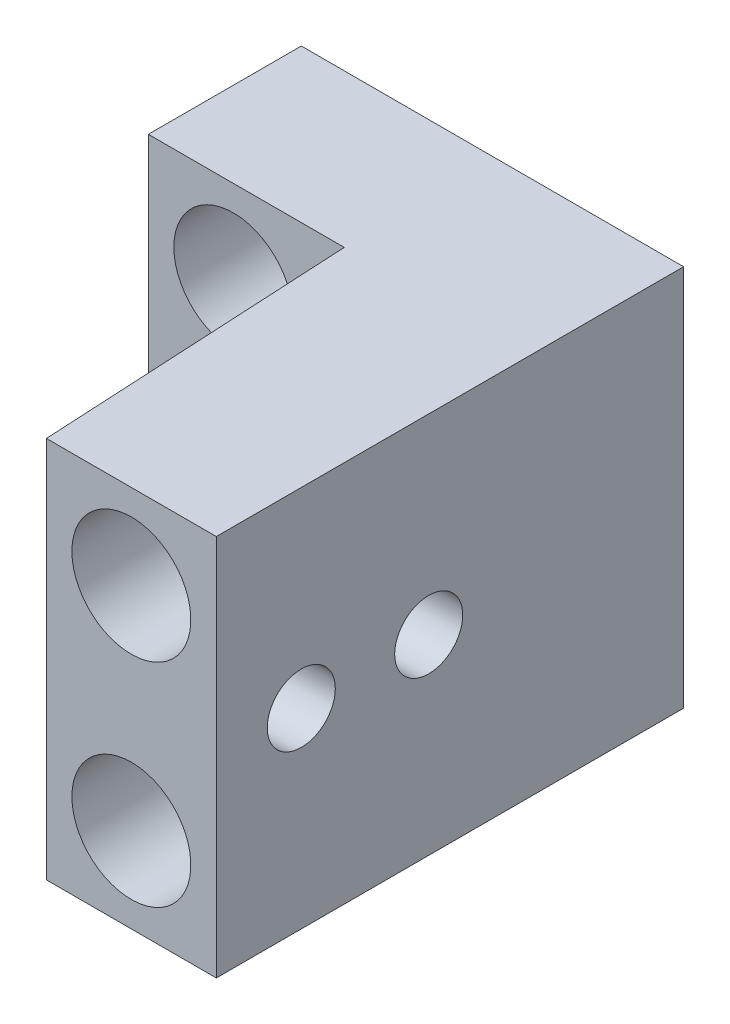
ISO-10303-21;
HEADER;
FILE_DESCRIPTION(('STEP AP214'),'2;1');
FILE_NAME('part.step','',(''),(''),'','','');
FILE_SCHEMA(('AUTOMOTIVE_DESIGN { 1 0 10303 214 1 1 1 1 }'));
ENDSEC;
DATA;
#1=APPLICATION_CONTEXT('core data for automotive mechanical design processes');
#2=APPLICATION_PROTOCOL_DEFINITION('international standard','automotive_design',2000,#1);
#3=PRODUCT_CONTEXT('',#1,'mechanical');
#4=PRODUCT('Part','Part','',(#3));
#5=PRODUCT_RELATED_PRODUCT_CATEGORY('part','',(#4));
#6=PRODUCT_DEFINITION_FORMATION('','',#4);
#7=PRODUCT_DEFINITION_CONTEXT('part definition',#1,'design');
#8=PRODUCT_DEFINITION('design','',#6,#7);
#9=PRODUCT_DEFINITION_SHAPE('','',#8);
#10=(LENGTH_UNIT() NAMED_UNIT(*) SI_UNIT(.MILLI.,.METRE.));
#11=(NAMED_UNIT(*) PLANE_ANGLE_UNIT() SI_UNIT($,.RADIAN.));
#12=(NAMED_UNIT(*) SI_UNIT($,.STERADIAN.) SOLID_ANGLE_UNIT());
#13=UNCERTAINTY_MEASURE_WITH_UNIT(LENGTH_MEASURE(1.E-05),#10,'distance_accuracy_value','');
#14=(GEOMETRIC_REPRESENTATION_CONTEXT(3) GLOBAL_UNCERTAINTY_ASSIGNED_CONTEXT((#13)) GLOBAL_UNIT_ASSIGNED_CONTEXT((#10,
#11,#12)) REPRESENTATION_CONTEXT('',''));
#15=CARTESIAN_POINT('',(0.,0.,0.));
#16=DIRECTION('',(0.,0.,1.));
#17=DIRECTION('',(1.,0.,0.));
#18=AXIS2_PLACEMENT_3D('',#15,#16,#17);
#19=CARTESIAN_POINT('',(-10.,-10.,18.));
#20=DIRECTION('',(0.,0.,1.));
#21=DIRECTION('',(-1.,0.,0.));
#22=AXIS2_PLACEMENT_3D('',#19,#20,#21);
#23=PLANE('',#22);
#24=CARTESIAN_POINT('',(0.,25.,18.));
#25=DIRECTION('',(0.,0.,1.));
#26=DIRECTION('',(-1.,0.,0.));
#27=AXIS2_PLACEMENT_3D('',#24,#25,#26);
#28=CIRCLE('',#27,7.);
#29=CARTESIAN_POINT('',(-7.,25.,18.));
#30=VERTEX_POINT('',#29);
#31=EDGE_CURVE('E147',#30,#30,#28,.T.);
#32=ORIENTED_EDGE('',*,*,#31,.F.);
#33=EDGE_LOOP('',(#32));
#34=FACE_BOUND('',#33,.T.);
#35=DIRECTION('',(1.,0.,0.));
#36=VECTOR('',#35,1.);
#37=CARTESIAN_POINT('',(-10.,-10.,18.));
#38=LINE('',#37,#36);
#39=CARTESIAN_POINT('',(-10.,-10.,18.));
#40=VERTEX_POINT('',#39);
#41=CARTESIAN_POINT('',(13.0609121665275,-10.,18.));
#42=VERTEX_POINT('',#41);
#43=EDGE_CURVE('E104',#40,#42,#38,.T.);
#44=ORIENTED_EDGE('',*,*,#43,.T.);
#45=DIRECTION('',(0.,1.,0.));
#46=VECTOR('',#45,1.);
#47=CARTESIAN_POINT('',(13.0609121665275,-10.,18.));
#48=LINE('',#47,#46);
#49=CARTESIAN_POINT('',(13.0609121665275,35.,18.));
#50=VERTEX_POINT('',#49);
#51=EDGE_CURVE('E75',#42,#50,#48,.T.);
#52=ORIENTED_EDGE('',*,*,#51,.T.);
#53=DIRECTION('',(1.,0.,0.));
#54=VECTOR('',#53,1.);
#55=CARTESIAN_POINT('',(-10.,35.,18.));
#56=LINE('',#55,#54);
#57=CARTESIAN_POINT('',(-10.,35.,18.));
#58=VERTEX_POINT('',#57);
#59=EDGE_CURVE('E82',#58,#50,#56,.T.);
#60=ORIENTED_EDGE('',*,*,#59,.F.);
#61=DIRECTION('',(0.,1.,0.));
#62=VECTOR('',#61,1.);
#63=CARTESIAN_POINT('',(-10.,-10.,18.));
#64=LINE('',#63,#62);
#65=EDGE_CURVE('E65',#40,#58,#64,.T.);
#66=ORIENTED_EDGE('',*,*,#65,.F.);
#67=EDGE_LOOP('',(#44,#52,#60,#66));
#68=FACE_BOUND('',#67,.T.);
#69=CARTESIAN_POINT('',(0.,0.,18.));
#70=DIRECTION('',(0.,0.,1.));
#71=DIRECTION('',(-1.,0.,0.));
#72=AXIS2_PLACEMENT_3D('',#69,#70,#71);
#73=CIRCLE('',#72,7.);
#74=CARTESIAN_POINT('',(-7.,0.,18.));
#75=VERTEX_POINT('',#74);
#76=EDGE_CURVE('E135',#75,#75,#73,.T.);
#77=ORIENTED_EDGE('',*,*,#76,.F.);
#78=EDGE_LOOP('',(#77));
#79=FACE_BOUND('',#78,.T.);
#80=ADVANCED_FACE('F14',(#34,#68,#79),#23,.T.);
#81=CARTESIAN_POINT('',(35.,-10.,0.));
#82=DIRECTION('',(0.,0.,-1.));
#83=DIRECTION('',(1.,0.,0.));
#84=AXIS2_PLACEMENT_3D('',#81,#82,#83);
#85=PLANE('',#84);
#86=CARTESIAN_POINT('',(0.,25.,0.));
#87=DIRECTION('',(0.,0.,1.));
#88=DIRECTION('',(-1.,0.,0.));
#89=AXIS2_PLACEMENT_3D('',#86,#87,#88);
#90=CIRCLE('',#89,4.5);
#91=CARTESIAN_POINT('',(-4.5,25.,0.));
#92=VERTEX_POINT('',#91);
#93=EDGE_CURVE('E138',#92,#92,#90,.T.);
#94=ORIENTED_EDGE('',*,*,#93,.T.);
#95=EDGE_LOOP('',(#94));
#96=FACE_BOUND('',#95,.T.);
#97=CARTESIAN_POINT('',(25.,25.,0.));
#98=DIRECTION('',(0.,0.,1.));
#99=DIRECTION('',(-1.,0.,0.));
#100=AXIS2_PLACEMENT_3D('',#97,#98,#99);
#101=CIRCLE('',#100,4.5);
#102=CARTESIAN_POINT('',(20.5,25.,0.));
#103=VERTEX_POINT('',#102);
#104=EDGE_CURVE('E86',#103,#103,#101,.T.);
#105=ORIENTED_EDGE('',*,*,#104,.T.);
#106=EDGE_LOOP('',(#105));
#107=FACE_BOUND('',#106,.T.);
#108=DIRECTION('',(0.,1.,0.));
#109=VECTOR('',#108,1.);
#110=CARTESIAN_POINT('',(35.,-10.,0.));
#111=LINE('',#110,#109);
#112=CARTESIAN_POINT('',(35.,-10.,0.));
#113=VERTEX_POINT('',#112);
#114=CARTESIAN_POINT('',(35.,35.,0.));
#115=VERTEX_POINT('',#114);
#116=EDGE_CURVE('E23',#113,#115,#111,.T.);
#117=ORIENTED_EDGE('',*,*,#116,.F.);
#118=DIRECTION('',(-1.,0.,0.));
#119=VECTOR('',#118,1.);
#120=CARTESIAN_POINT('',(35.,-10.,0.));
#121=LINE('',#120,#119);
#122=CARTESIAN_POINT('',(-10.,-10.,0.));
#123=VERTEX_POINT('',#122);
#124=EDGE_CURVE('E76',#113,#123,#121,.T.);
#125=ORIENTED_EDGE('',*,*,#124,.T.);
#126=DIRECTION('',(0.,1.,0.));
#127=VECTOR('',#126,1.);
#128=CARTESIAN_POINT('',(-10.,-10.,0.));
#129=LINE('',#128,#127);
#130=CARTESIAN_POINT('',(-10.,35.,0.));
#131=VERTEX_POINT('',#130);
#132=EDGE_CURVE('E9',#123,#131,#129,.T.);
#133=ORIENTED_EDGE('',*,*,#132,.T.);
#134=DIRECTION('',(-1.,0.,0.));
#135=VECTOR('',#134,1.);
#136=CARTESIAN_POINT('',(35.,35.,0.));
#137=LINE('',#136,#135);
#138=EDGE_CURVE('E85',#115,#131,#137,.T.);
#139=ORIENTED_EDGE('',*,*,#138,.F.);
#140=EDGE_LOOP('',(#117,#125,#133,#139));
#141=FACE_BOUND('',#140,.T.);
#142=CARTESIAN_POINT('',(25.,0.,0.));
#143=DIRECTION('',(0.,0.,1.));
#144=DIRECTION('',(-1.,0.,0.));
#145=AXIS2_PLACEMENT_3D('',#142,#143,#144);
#146=CIRCLE('',#145,4.5);
#147=CARTESIAN_POINT('',(20.5,0.,0.));
#148=VERTEX_POINT('',#147);
#149=EDGE_CURVE('E159',#148,#148,#146,.T.);
#150=ORIENTED_EDGE('',*,*,#149,.T.);
#151=EDGE_LOOP('',(#150));
#152=FACE_BOUND('',#151,.T.);
#153=CARTESIAN_POINT('',(0.,0.,0.));
#154=DIRECTION('',(0.,0.,1.));
#155=DIRECTION('',(-1.,0.,0.));
#156=AXIS2_PLACEMENT_3D('',#153,#154,#155);
#157=CIRCLE('',#156,4.5);
#158=CARTESIAN_POINT('',(-4.5,0.,0.));
#159=VERTEX_POINT('',#158);
#160=EDGE_CURVE('E119',#159,#159,#157,.T.);
#161=ORIENTED_EDGE('',*,*,#160,.T.);
#162=EDGE_LOOP('',(#161));
#163=FACE_BOUND('',#162,.T.);
#164=ADVANCED_FACE('F16',(#96,#107,#141,#152,#163),#85,.T.);
#165=CARTESIAN_POINT('',(15.,-10.,55.));
#166=DIRECTION('',(0.,0.,1.));
#167=DIRECTION('',(-1.,0.,0.));
#168=AXIS2_PLACEMENT_3D('',#165,#166,#167);
#169=PLANE('',#168);
#170=CARTESIAN_POINT('',(25.,25.,55.));
#171=DIRECTION('',(0.,0.,1.));
#172=DIRECTION('',(-1.,0.,0.));
#173=AXIS2_PLACEMENT_3D('',#170,#171,#172);
#174=CIRCLE('',#173,7.);
#175=CARTESIAN_POINT('',(18.,25.,55.));
#176=VERTEX_POINT('',#175);
#177=EDGE_CURVE('E162',#176,#176,#174,.T.);
#178=ORIENTED_EDGE('',*,*,#177,.F.);
#179=EDGE_LOOP('',(#178));
#180=FACE_BOUND('',#179,.T.);
#181=DIRECTION('',(0.,1.,0.));
#182=VECTOR('',#181,1.);
#183=CARTESIAN_POINT('',(15.,-10.,55.));
#184=LINE('',#183,#182);
#185=CARTESIAN_POINT('',(15.,-10.,55.));
#186=VERTEX_POINT('',#185);
#187=CARTESIAN_POINT('',(15.,35.,55.));
#188=VERTEX_POINT('',#187);
#189=EDGE_CURVE('E108',#186,#188,#184,.T.);
#190=ORIENTED_EDGE('',*,*,#189,.F.);
#191=DIRECTION('',(1.,0.,0.));
#192=VECTOR('',#191,1.);
#193=CARTESIAN_POINT('',(15.,-10.,55.));
#194=LINE('',#193,#192);
#195=CARTESIAN_POINT('',(35.,-10.,55.));
#196=VERTEX_POINT('',#195);
#197=EDGE_CURVE('E98',#186,#196,#194,.T.);
#198=ORIENTED_EDGE('',*,*,#197,.T.);
#199=DIRECTION('',(0.,1.,0.));
#200=VECTOR('',#199,1.);
#201=CARTESIAN_POINT('',(35.,-10.,55.));
#202=LINE('',#201,#200);
#203=CARTESIAN_POINT('',(35.,35.,55.));
#204=VERTEX_POINT('',#203);
#205=EDGE_CURVE('E110',#196,#204,#202,.T.);
#206=ORIENTED_EDGE('',*,*,#205,.T.);
#207=DIRECTION('',(1.,0.,0.));
#208=VECTOR('',#207,1.);
#209=CARTESIAN_POINT('',(15.,35.,55.));
#210=LINE('',#209,#208);
#211=EDGE_CURVE('E91',#188,#204,#210,.T.);
#212=ORIENTED_EDGE('',*,*,#211,.F.);
#213=EDGE_LOOP('',(#190,#198,#206,#212));
#214=FACE_BOUND('',#213,.T.);
#215=CARTESIAN_POINT('',(25.,0.,55.));
#216=DIRECTION('',(0.,0.,1.));
#217=DIRECTION('',(-1.,0.,0.));
#218=AXIS2_PLACEMENT_3D('',#215,#216,#217);
#219=CIRCLE('',#218,7.);
#220=CARTESIAN_POINT('',(18.,0.,55.));
#221=VERTEX_POINT('',#220);
#222=EDGE_CURVE('E150',#221,#221,#219,.T.);
#223=ORIENTED_EDGE('',*,*,#222,.F.);
#224=EDGE_LOOP('',(#223));
#225=FACE_BOUND('',#224,.T.);
#226=ADVANCED_FACE('F188',(#180,#214,#225),#169,.T.);
#227=CARTESIAN_POINT('',(-10.,35.,55.));
#228=DIRECTION('',(0.,1.,0.));
#229=DIRECTION('',(0.,0.,-1.));
#230=AXIS2_PLACEMENT_3D('',#227,#228,#229);
#231=PLANE('',#230);
#232=DIRECTION('',(0.,0.,1.));
#233=VECTOR('',#232,1.);
#234=CARTESIAN_POINT('',(-10.,35.,0.));
#235=LINE('',#234,#233);
#236=EDGE_CURVE('E68',#131,#58,#235,.T.);
#237=ORIENTED_EDGE('',*,*,#236,.T.);
#238=ORIENTED_EDGE('',*,*,#59,.T.);
#239=DIRECTION('',(-0.0523359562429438,0.,-0.998629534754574));
#240=VECTOR('',#239,1.);
#241=CARTESIAN_POINT('',(15.,35.,55.));
#242=LINE('',#241,#240);
#243=EDGE_CURVE('E89',#188,#50,#242,.T.);
#244=ORIENTED_EDGE('',*,*,#243,.F.);
#245=ORIENTED_EDGE('',*,*,#211,.T.);
#246=DIRECTION('',(0.,0.,-1.));
#247=VECTOR('',#246,1.);
#248=CARTESIAN_POINT('',(35.,35.,55.));
#249=LINE('',#248,#247);
#250=EDGE_CURVE('E174',#204,#115,#249,.T.);
#251=ORIENTED_EDGE('',*,*,#250,.T.);
#252=ORIENTED_EDGE('',*,*,#138,.T.);
#253=EDGE_LOOP('',(#237,#238,#244,#245,#251,#252));
#254=FACE_BOUND('',#253,.T.);
#255=ADVANCED_FACE('F80',(#254),#231,.T.);
#256=CARTESIAN_POINT('',(-10.,-10.,0.));
#257=DIRECTION('',(-1.,0.,0.));
#258=DIRECTION('',(0.,0.,-1.));
#259=AXIS2_PLACEMENT_3D('',#256,#257,#258);
#260=PLANE('',#259);
#261=ORIENTED_EDGE('',*,*,#132,.F.);
#262=DIRECTION('',(0.,0.,1.));
#263=VECTOR('',#262,1.);
#264=CARTESIAN_POINT('',(-10.,-10.,0.));
#265=LINE('',#264,#263);
#266=EDGE_CURVE('E70',#123,#40,#265,.T.);
#267=ORIENTED_EDGE('',*,*,#266,.T.);
#268=ORIENTED_EDGE('',*,*,#65,.T.);
#269=ORIENTED_EDGE('',*,*,#236,.F.);
#270=EDGE_LOOP('',(#261,#267,#268,#269));
#271=FACE_BOUND('',#270,.T.);
#272=ADVANCED_FACE('F67',(#271),#260,.T.);
#273=CARTESIAN_POINT('',(35.,-10.,55.));
#274=DIRECTION('',(1.,0.,0.));
#275=DIRECTION('',(0.,0.,1.));
#276=AXIS2_PLACEMENT_3D('',#273,#274,#275);
#277=PLANE('',#276);
#278=CARTESIAN_POINT('',(35.,12.5,30.));
#279=DIRECTION('',(1.,0.,0.));
#280=DIRECTION('',(0.,0.,1.));
#281=AXIS2_PLACEMENT_3D('',#278,#279,#280);
#282=ELLIPSE('',#281,4.00548938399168,4.);
#283=CARTESIAN_POINT('',(35.,12.5,34.0054893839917));
#284=VERTEX_POINT('',#283);
#285=EDGE_CURVE('E115',#284,#284,#282,.T.);
#286=ORIENTED_EDGE('',*,*,#285,.F.);
#287=EDGE_LOOP('',(#286));
#288=FACE_BOUND('',#287,.T.);
#289=CARTESIAN_POINT('',(35.,12.5,45.));
#290=DIRECTION('',(1.,0.,0.));
#291=DIRECTION('',(0.,0.,1.));
#292=AXIS2_PLACEMENT_3D('',#289,#290,#291);
#293=ELLIPSE('',#292,4.00548938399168,4.);
#294=CARTESIAN_POINT('',(35.,12.5,49.0054893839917));
#295=VERTEX_POINT('',#294);
#296=EDGE_CURVE('E114',#295,#295,#293,.T.);
#297=ORIENTED_EDGE('',*,*,#296,.F.);
#298=EDGE_LOOP('',(#297));
#299=FACE_BOUND('',#298,.T.);
#300=ORIENTED_EDGE('',*,*,#205,.F.);
#301=DIRECTION('',(0.,0.,-1.));
#302=VECTOR('',#301,1.);
#303=CARTESIAN_POINT('',(35.,-10.,55.));
#304=LINE('',#303,#302);
#305=EDGE_CURVE('E96',#196,#113,#304,.T.);
#306=ORIENTED_EDGE('',*,*,#305,.T.);
#307=ORIENTED_EDGE('',*,*,#116,.T.);
#308=ORIENTED_EDGE('',*,*,#250,.F.);
#309=EDGE_LOOP('',(#300,#306,#307,#308));
#310=FACE_BOUND('',#309,.T.);
#311=ADVANCED_FACE('F180',(#288,#299,#310),#277,.T.);
#312=CARTESIAN_POINT('',(15.,-10.,55.));
#313=DIRECTION('',(0.998629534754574,0.,-0.0523359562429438));
#314=DIRECTION('',(0.0523359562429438,0.,0.998629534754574));
#315=AXIS2_PLACEMENT_3D('',#312,#313,#314);
#316=PLANE('',#315);
#317=CARTESIAN_POINT('',(13.7481752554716,12.5,31.1137609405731));
#318=DIRECTION('',(0.998629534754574,0.,-0.0523359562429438));
#319=DIRECTION('',(0.0523359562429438,0.,0.998629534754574));
#320=AXIS2_PLACEMENT_3D('',#317,#318,#319);
#321=CIRCLE('',#320,4.);
#322=CARTESIAN_POINT('',(13.9575190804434,12.5,35.1082790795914));
#323=VERTEX_POINT('',#322);
#324=EDGE_CURVE('E18',#323,#323,#321,.T.);
#325=ORIENTED_EDGE('',*,*,#324,.T.);
#326=EDGE_LOOP('',(#325));
#327=FACE_BOUND('',#326,.T.);
#328=CARTESIAN_POINT('',(14.532138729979,12.5,46.0726751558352));
#329=DIRECTION('',(0.998629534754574,0.,-0.0523359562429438));
#330=DIRECTION('',(0.0523359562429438,0.,0.998629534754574));
#331=AXIS2_PLACEMENT_3D('',#328,#329,#330);
#332=CIRCLE('',#331,4.);
#333=CARTESIAN_POINT('',(14.7414825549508,12.5,50.0671932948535));
#334=VERTEX_POINT('',#333);
#335=EDGE_CURVE('E112',#334,#334,#332,.T.);
#336=ORIENTED_EDGE('',*,*,#335,.T.);
#337=EDGE_LOOP('',(#336));
#338=FACE_BOUND('',#337,.T.);
#339=ORIENTED_EDGE('',*,*,#51,.F.);
#340=DIRECTION('',(-0.0523359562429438,0.,-0.998629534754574));
#341=VECTOR('',#340,1.);
#342=CARTESIAN_POINT('',(15.,-10.,55.));
#343=LINE('',#342,#341);
#344=EDGE_CURVE('E101',#186,#42,#343,.T.);
#345=ORIENTED_EDGE('',*,*,#344,.F.);
#346=ORIENTED_EDGE('',*,*,#189,.T.);
#347=ORIENTED_EDGE('',*,*,#243,.T.);
#348=EDGE_LOOP('',(#339,#345,#346,#347));
#349=FACE_BOUND('',#348,.T.);
#350=ADVANCED_FACE('F222',(#327,#338,#349),#316,.F.);
#351=CARTESIAN_POINT('',(-10.,-10.,55.));
#352=DIRECTION('',(0.,1.,0.));
#353=DIRECTION('',(0.,0.,-1.));
#354=AXIS2_PLACEMENT_3D('',#351,#352,#353);
#355=PLANE('',#354);
#356=ORIENTED_EDGE('',*,*,#266,.F.);
#357=ORIENTED_EDGE('',*,*,#124,.F.);
#358=ORIENTED_EDGE('',*,*,#305,.F.);
#359=ORIENTED_EDGE('',*,*,#197,.F.);
#360=ORIENTED_EDGE('',*,*,#344,.T.);
#361=ORIENTED_EDGE('',*,*,#43,.F.);
#362=EDGE_LOOP('',(#356,#357,#358,#359,#360,#361));
#363=FACE_BOUND('',#362,.T.);
#364=ADVANCED_FACE('F185',(#363),#355,.F.);
#365=CARTESIAN_POINT('',(25.,25.,55.));
#366=DIRECTION('',(0.,0.,1.));
#367=DIRECTION('',(-1.,0.,0.));
#368=AXIS2_PLACEMENT_3D('',#365,#366,#367);
#369=CYLINDRICAL_SURFACE('',#368,4.5);
#370=CARTESIAN_POINT('',(25.,25.,20.));
#371=DIRECTION('',(0.,0.,1.));
#372=DIRECTION('',(-1.,0.,0.));
#373=AXIS2_PLACEMENT_3D('',#370,#371,#372);
#374=CIRCLE('',#373,4.5);
#375=CARTESIAN_POINT('',(20.5,25.,20.));
#376=VERTEX_POINT('',#375);
#377=EDGE_CURVE('E168',#376,#376,#374,.T.);
#378=ORIENTED_EDGE('',*,*,#377,.T.);
#379=EDGE_LOOP('',(#378));
#380=FACE_BOUND('',#379,.T.);
#381=ORIENTED_EDGE('',*,*,#104,.F.);
#382=EDGE_LOOP('',(#381));
#383=FACE_BOUND('',#382,.T.);
#384=ADVANCED_FACE('F246',(#380,#383),#369,.F.);
#385=CARTESIAN_POINT('',(20.5,25.,20.));
#386=DIRECTION('',(0.,0.,1.));
#387=DIRECTION('',(-1.,0.,0.));
#388=AXIS2_PLACEMENT_3D('',#385,#386,#387);
#389=PLANE('',#388);
#390=CARTESIAN_POINT('',(25.,25.,20.));
#391=DIRECTION('',(0.,0.,1.));
#392=DIRECTION('',(-1.,0.,0.));
#393=AXIS2_PLACEMENT_3D('',#390,#391,#392);
#394=CIRCLE('',#393,7.);
#395=CARTESIAN_POINT('',(18.,25.,20.));
#396=VERTEX_POINT('',#395);
#397=EDGE_CURVE('E165',#396,#396,#394,.T.);
#398=ORIENTED_EDGE('',*,*,#397,.T.);
#399=EDGE_LOOP('',(#398));
#400=FACE_BOUND('',#399,.T.);
#401=ORIENTED_EDGE('',*,*,#377,.F.);
#402=EDGE_LOOP('',(#401));
#403=FACE_BOUND('',#402,.T.);
#404=ADVANCED_FACE('F253',(#400,#403),#389,.T.);
#405=CARTESIAN_POINT('',(25.,25.,55.));
#406=DIRECTION('',(0.,0.,1.));
#407=DIRECTION('',(-1.,0.,0.));
#408=AXIS2_PLACEMENT_3D('',#405,#406,#407);
#409=CYLINDRICAL_SURFACE('',#408,7.);
#410=ORIENTED_EDGE('',*,*,#177,.T.);
#411=EDGE_LOOP('',(#410));
#412=FACE_BOUND('',#411,.T.);
#413=ORIENTED_EDGE('',*,*,#397,.F.);
#414=EDGE_LOOP('',(#413));
#415=FACE_BOUND('',#414,.T.);
#416=ADVANCED_FACE('F259',(#412,#415),#409,.F.);
#417=CARTESIAN_POINT('',(25.,0.,55.));
#418=DIRECTION('',(0.,0.,1.));
#419=DIRECTION('',(-1.,0.,0.));
#420=AXIS2_PLACEMENT_3D('',#417,#418,#419);
#421=CYLINDRICAL_SURFACE('',#420,4.5);
#422=CARTESIAN_POINT('',(25.,0.,20.));
#423=DIRECTION('',(0.,0.,1.));
#424=DIRECTION('',(-1.,0.,0.));
#425=AXIS2_PLACEMENT_3D('',#422,#423,#424);
#426=CIRCLE('',#425,4.5);
#427=CARTESIAN_POINT('',(20.5,0.,20.));
#428=VERTEX_POINT('',#427);
#429=EDGE_CURVE('E156',#428,#428,#426,.T.);
#430=ORIENTED_EDGE('',*,*,#429,.T.);
#431=EDGE_LOOP('',(#430));
#432=FACE_BOUND('',#431,.T.);
#433=ORIENTED_EDGE('',*,*,#149,.F.);
#434=EDGE_LOOP('',(#433));
#435=FACE_BOUND('',#434,.T.);
#436=ADVANCED_FACE('F270',(#432,#435),#421,.F.);
#437=CARTESIAN_POINT('',(20.5,0.,20.));
#438=DIRECTION('',(0.,0.,1.));
#439=DIRECTION('',(-1.,0.,0.));
#440=AXIS2_PLACEMENT_3D('',#437,#438,#439);
#441=PLANE('',#440);
#442=CARTESIAN_POINT('',(25.,0.,20.));
#443=DIRECTION('',(0.,0.,1.));
#444=DIRECTION('',(-1.,0.,0.));
#445=AXIS2_PLACEMENT_3D('',#442,#443,#444);
#446=CIRCLE('',#445,7.);
#447=CARTESIAN_POINT('',(18.,0.,20.));
#448=VERTEX_POINT('',#447);
#449=EDGE_CURVE('E153',#448,#448,#446,.T.);
#450=ORIENTED_EDGE('',*,*,#449,.T.);
#451=EDGE_LOOP('',(#450));
#452=FACE_BOUND('',#451,.T.);
#453=ORIENTED_EDGE('',*,*,#429,.F.);
#454=EDGE_LOOP('',(#453));
#455=FACE_BOUND('',#454,.T.);
#456=ADVANCED_FACE('F276',(#452,#455),#441,.T.);
#457=CARTESIAN_POINT('',(25.,0.,55.));
#458=DIRECTION('',(0.,0.,1.));
#459=DIRECTION('',(-1.,0.,0.));
#460=AXIS2_PLACEMENT_3D('',#457,#458,#459);
#461=CYLINDRICAL_SURFACE('',#460,7.);
#462=ORIENTED_EDGE('',*,*,#222,.T.);
#463=EDGE_LOOP('',(#462));
#464=FACE_BOUND('',#463,.T.);
#465=ORIENTED_EDGE('',*,*,#449,.F.);
#466=EDGE_LOOP('',(#465));
#467=FACE_BOUND('',#466,.T.);
#468=ADVANCED_FACE('F280',(#464,#467),#461,.F.);
#469=CARTESIAN_POINT('',(0.,25.,18.));
#470=DIRECTION('',(0.,0.,1.));
#471=DIRECTION('',(-1.,0.,0.));
#472=AXIS2_PLACEMENT_3D('',#469,#470,#471);
#473=CYLINDRICAL_SURFACE('',#472,7.);
#474=ORIENTED_EDGE('',*,*,#31,.T.);
#475=EDGE_LOOP('',(#474));
#476=FACE_BOUND('',#475,.T.);
#477=CARTESIAN_POINT('',(0.,25.,7.));
#478=DIRECTION('',(0.,0.,1.));
#479=DIRECTION('',(-1.,0.,0.));
#480=AXIS2_PLACEMENT_3D('',#477,#478,#479);
#481=CIRCLE('',#480,7.);
#482=CARTESIAN_POINT('',(-7.,25.,7.));
#483=VERTEX_POINT('',#482);
#484=EDGE_CURVE('E144',#483,#483,#481,.T.);
#485=ORIENTED_EDGE('',*,*,#484,.F.);
#486=EDGE_LOOP('',(#485));
#487=FACE_BOUND('',#486,.T.);
#488=ADVANCED_FACE('F284',(#476,#487),#473,.F.);
#489=CARTESIAN_POINT('',(-4.5,25.,7.));
#490=DIRECTION('',(0.,0.,1.));
#491=DIRECTION('',(-1.,0.,0.));
#492=AXIS2_PLACEMENT_3D('',#489,#490,#491);
#493=PLANE('',#492);
#494=ORIENTED_EDGE('',*,*,#484,.T.);
#495=EDGE_LOOP('',(#494));
#496=FACE_BOUND('',#495,.T.);
#497=CARTESIAN_POINT('',(0.,25.,7.));
#498=DIRECTION('',(0.,0.,1.));
#499=DIRECTION('',(-1.,0.,0.));
#500=AXIS2_PLACEMENT_3D('',#497,#498,#499);
#501=CIRCLE('',#500,4.5);
#502=CARTESIAN_POINT('',(-4.5,25.,7.));
#503=VERTEX_POINT('',#502);
#504=EDGE_CURVE('E141',#503,#503,#501,.T.);
#505=ORIENTED_EDGE('',*,*,#504,.F.);
#506=EDGE_LOOP('',(#505));
#507=FACE_BOUND('',#506,.T.);
#508=ADVANCED_FACE('F288',(#496,#507),#493,.T.);
#509=CARTESIAN_POINT('',(0.,25.,18.));
#510=DIRECTION('',(0.,0.,1.));
#511=DIRECTION('',(-1.,0.,0.));
#512=AXIS2_PLACEMENT_3D('',#509,#510,#511);
#513=CYLINDRICAL_SURFACE('',#512,4.5);
#514=ORIENTED_EDGE('',*,*,#504,.T.);
#515=EDGE_LOOP('',(#514));
#516=FACE_BOUND('',#515,.T.);
#517=ORIENTED_EDGE('',*,*,#93,.F.);
#518=EDGE_LOOP('',(#517));
#519=FACE_BOUND('',#518,.T.);
#520=ADVANCED_FACE('F292',(#516,#519),#513,.F.);
#521=CARTESIAN_POINT('',(0.,0.,18.));
#522=DIRECTION('',(0.,0.,1.));
#523=DIRECTION('',(-1.,0.,0.));
#524=AXIS2_PLACEMENT_3D('',#521,#522,#523);
#525=CYLINDRICAL_SURFACE('',#524,7.);
#526=ORIENTED_EDGE('',*,*,#76,.T.);
#527=EDGE_LOOP('',(#526));
#528=FACE_BOUND('',#527,.T.);
#529=CARTESIAN_POINT('',(0.,0.,7.));
#530=DIRECTION('',(0.,0.,1.));
#531=DIRECTION('',(-1.,0.,0.));
#532=AXIS2_PLACEMENT_3D('',#529,#530,#531);
#533=CIRCLE('',#532,7.);
#534=CARTESIAN_POINT('',(-7.,0.,7.));
#535=VERTEX_POINT('',#534);
#536=EDGE_CURVE('E132',#535,#535,#533,.T.);
#537=ORIENTED_EDGE('',*,*,#536,.F.);
#538=EDGE_LOOP('',(#537));
#539=FACE_BOUND('',#538,.T.);
#540=ADVANCED_FACE('F209',(#528,#539),#525,.F.);
#541=CARTESIAN_POINT('',(-4.5,0.,7.));
#542=DIRECTION('',(0.,0.,1.));
#543=DIRECTION('',(-1.,0.,0.));
#544=AXIS2_PLACEMENT_3D('',#541,#542,#543);
#545=PLANE('',#544);
#546=ORIENTED_EDGE('',*,*,#536,.T.);
#547=EDGE_LOOP('',(#546));
#548=FACE_BOUND('',#547,.T.);
#549=CARTESIAN_POINT('',(0.,0.,7.));
#550=DIRECTION('',(0.,0.,1.));
#551=DIRECTION('',(-1.,0.,0.));
#552=AXIS2_PLACEMENT_3D('',#549,#550,#551);
#553=CIRCLE('',#552,4.5);
#554=CARTESIAN_POINT('',(-4.5,0.,7.));
#555=VERTEX_POINT('',#554);
#556=EDGE_CURVE('E129',#555,#555,#553,.T.);
#557=ORIENTED_EDGE('',*,*,#556,.F.);
#558=EDGE_LOOP('',(#557));
#559=FACE_BOUND('',#558,.T.);
#560=ADVANCED_FACE('F197',(#548,#559),#545,.T.);
#561=CARTESIAN_POINT('',(0.,0.,18.));
#562=DIRECTION('',(0.,0.,1.));
#563=DIRECTION('',(-1.,0.,0.));
#564=AXIS2_PLACEMENT_3D('',#561,#562,#563);
#565=CYLINDRICAL_SURFACE('',#564,4.5);
#566=ORIENTED_EDGE('',*,*,#556,.T.);
#567=EDGE_LOOP('',(#566));
#568=FACE_BOUND('',#567,.T.);
#569=ORIENTED_EDGE('',*,*,#160,.F.);
#570=EDGE_LOOP('',(#569));
#571=FACE_BOUND('',#570,.T.);
#572=ADVANCED_FACE('F194',(#568,#571),#565,.F.);
#573=CARTESIAN_POINT('',(2.58901920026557,12.5,46.6985875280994));
#574=DIRECTION('',(-0.998629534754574,0.,0.0523359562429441));
#575=DIRECTION('',(-0.0523359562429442,0.,-0.998629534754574));
#576=AXIS2_PLACEMENT_3D('',#573,#574,#575);
#577=CYLINDRICAL_SURFACE('',#576,4.);
#578=ORIENTED_EDGE('',*,*,#296,.T.);
#579=EDGE_LOOP('',(#578));
#580=FACE_BOUND('',#579,.T.);
#581=ORIENTED_EDGE('',*,*,#335,.F.);
#582=EDGE_LOOP('',(#581));
#583=FACE_BOUND('',#582,.T.);
#584=ADVANCED_FACE('F196',(#580,#583),#577,.F.);
#585=CARTESIAN_POINT('',(2.58901920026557,12.5,31.6985875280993));
#586=DIRECTION('',(-0.998629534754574,0.,0.0523359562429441));
#587=DIRECTION('',(-0.0523359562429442,0.,-0.998629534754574));
#588=AXIS2_PLACEMENT_3D('',#585,#586,#587);
#589=CYLINDRICAL_SURFACE('',#588,4.);
#590=ORIENTED_EDGE('',*,*,#285,.T.);
#591=EDGE_LOOP('',(#590));
#592=FACE_BOUND('',#591,.T.);
#593=ORIENTED_EDGE('',*,*,#324,.F.);
#594=EDGE_LOOP('',(#593));
#595=FACE_BOUND('',#594,.T.);
#596=ADVANCED_FACE('F206',(#592,#595),#589,.F.);
#597=CLOSED_SHELL('',(#80,#164,#226,#255,#272,#311,#350,#364,#384,#404,#416,#436,#456,#468,#488,
#508,#520,#540,#560,#572,#584,#596));
#598=MANIFOLD_SOLID_BREP('B1',#597);
#599=ADVANCED_BREP_SHAPE_REPRESENTATION('',(#18,#598),#14);
#600=SHAPE_DEFINITION_REPRESENTATION(#9,#599);
ENDSEC;
END-ISO-10303-21;
